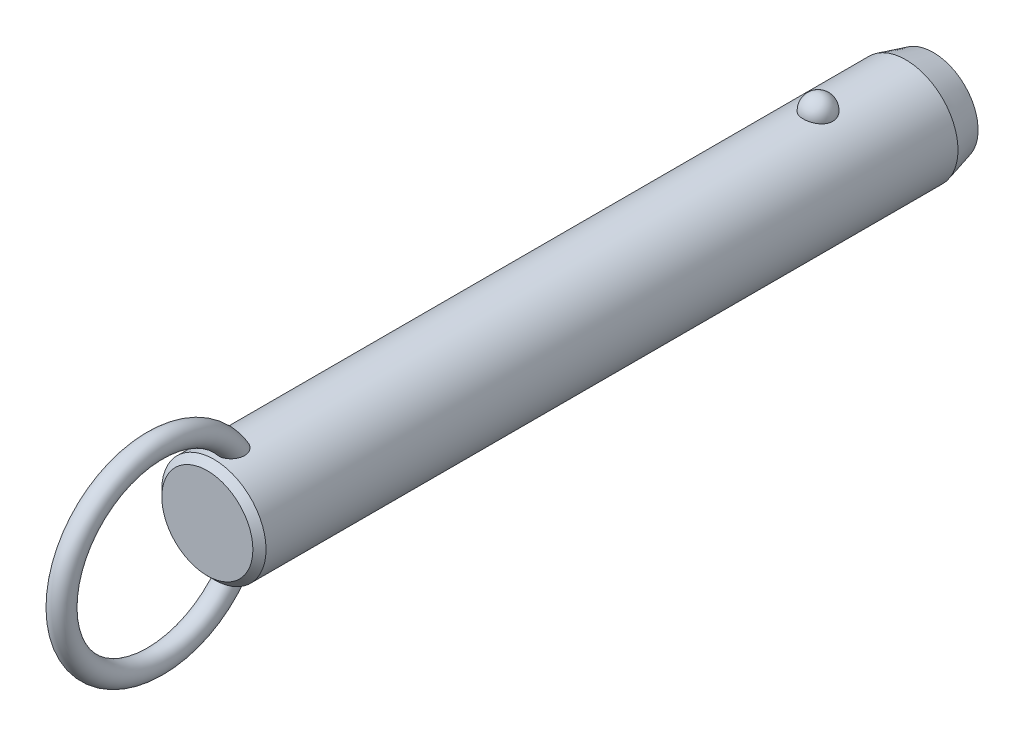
ISO-10303-21;
HEADER;
FILE_DESCRIPTION(('STEP AP214'),'2;1');
FILE_NAME('part.step','',(''),(''),'','','');
FILE_SCHEMA(('AUTOMOTIVE_DESIGN { 1 0 10303 214 1 1 1 1 }'));
ENDSEC;
DATA;
#1=APPLICATION_CONTEXT('core data for automotive mechanical design processes');
#2=APPLICATION_PROTOCOL_DEFINITION('international standard','automotive_design',2000,#1);
#3=PRODUCT_CONTEXT('',#1,'mechanical');
#4=PRODUCT('Part','Part','',(#3));
#5=PRODUCT_RELATED_PRODUCT_CATEGORY('part','',(#4));
#6=PRODUCT_DEFINITION_FORMATION('','',#4);
#7=PRODUCT_DEFINITION_CONTEXT('part definition',#1,'design');
#8=PRODUCT_DEFINITION('design','',#6,#7);
#9=PRODUCT_DEFINITION_SHAPE('','',#8);
#10=(LENGTH_UNIT() NAMED_UNIT(*) SI_UNIT(.MILLI.,.METRE.));
#11=(NAMED_UNIT(*) PLANE_ANGLE_UNIT() SI_UNIT($,.RADIAN.));
#12=(NAMED_UNIT(*) SI_UNIT($,.STERADIAN.) SOLID_ANGLE_UNIT());
#13=UNCERTAINTY_MEASURE_WITH_UNIT(LENGTH_MEASURE(1.E-05),#10,'distance_accuracy_value','');
#14=(GEOMETRIC_REPRESENTATION_CONTEXT(3) GLOBAL_UNCERTAINTY_ASSIGNED_CONTEXT((#13)) GLOBAL_UNIT_ASSIGNED_CONTEXT((#10,
#11,#12)) REPRESENTATION_CONTEXT('',''));
#15=CARTESIAN_POINT('',(0.,0.,0.));
#16=DIRECTION('',(0.,0.,1.));
#17=DIRECTION('',(1.,0.,0.));
#18=AXIS2_PLACEMENT_3D('',#15,#16,#17);
#19=CARTESIAN_POINT('',(0.,0.,99.1));
#20=DIRECTION('',(0.,0.,-1.));
#21=DIRECTION('',(-1.,0.,0.));
#22=AXIS2_PLACEMENT_3D('',#19,#20,#21);
#23=CYLINDRICAL_SURFACE('',#22,9.5);
#24=CARTESIAN_POINT('',(2.67259918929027,9.11631578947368,-2.70000000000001));
#25=CARTESIAN_POINT('',(2.6725968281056,9.11631786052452,-2.54909854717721));
#26=CARTESIAN_POINT('',(2.66030567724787,9.11994722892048,-2.39816735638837));
#27=CARTESIAN_POINT('',(2.6114347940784,9.13405924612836,-2.10058568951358));
#28=CARTESIAN_POINT('',(2.57484658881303,9.14454428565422,-1.95393672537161));
#29=CARTESIAN_POINT('',(2.47830875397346,9.17117631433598,-1.66916069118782));
#30=CARTESIAN_POINT('',(2.41836936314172,9.18732082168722,-1.53102991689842));
#31=CARTESIAN_POINT('',(2.27661331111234,9.22346780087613,-1.26705393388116));
#32=CARTESIAN_POINT('',(2.19479699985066,9.24347021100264,-1.14120852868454));
#33=CARTESIAN_POINT('',(2.01085282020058,9.28522401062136,-0.904632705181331));
#34=CARTESIAN_POINT('',(1.90862396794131,9.30698376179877,-0.793982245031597));
#35=CARTESIAN_POINT('',(1.6867437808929,9.34973971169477,-0.591607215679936));
#36=CARTESIAN_POINT('',(1.56709244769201,9.37073591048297,-0.499882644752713));
#37=CARTESIAN_POINT('',(1.31393976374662,9.40956370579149,-0.338167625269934));
#38=CARTESIAN_POINT('',(1.18048026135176,9.42740444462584,-0.268113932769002));
#39=CARTESIAN_POINT('',(0.903154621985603,9.45799906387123,-0.151390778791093));
#40=CARTESIAN_POINT('',(0.759289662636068,9.47075351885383,-0.104718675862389));
#41=CARTESIAN_POINT('',(0.468074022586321,9.48956256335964,-0.0367633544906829));
#42=CARTESIAN_POINT('',(0.320836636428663,9.49573643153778,-0.0150275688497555));
#43=CARTESIAN_POINT('',(0.0246714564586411,9.50112183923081,0.00396199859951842));
#44=CARTESIAN_POINT('',(-0.124256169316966,9.50033406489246,0.00121819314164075));
#45=CARTESIAN_POINT('',(-0.417264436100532,9.4919475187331,-0.0284441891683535));
#46=CARTESIAN_POINT('',(-0.56138413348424,9.48444885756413,-0.0550074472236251));
#47=CARTESIAN_POINT('',(-0.842986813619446,9.46357853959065,-0.131064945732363));
#48=CARTESIAN_POINT('',(-0.980469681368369,9.450206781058,-0.180559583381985));
#49=CARTESIAN_POINT('',(-1.24585005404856,9.41890822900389,-0.301476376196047));
#50=CARTESIAN_POINT('',(-1.37368611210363,9.40095498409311,-0.373026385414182));
#51=CARTESIAN_POINT('',(-1.61552738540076,9.36242964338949,-0.536025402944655));
#52=CARTESIAN_POINT('',(-1.72953116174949,9.34185727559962,-0.627476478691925));
#53=CARTESIAN_POINT('',(-1.9429225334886,9.29984568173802,-0.829844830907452));
#54=CARTESIAN_POINT('',(-2.04198021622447,9.27839736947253,-0.94110821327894));
#55=CARTESIAN_POINT('',(-2.22026460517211,9.23735994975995,-1.17883414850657));
#56=CARTESIAN_POINT('',(-2.29948985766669,9.21777097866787,-1.30529781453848));
#57=CARTESIAN_POINT('',(-2.43697287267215,9.18238994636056,-1.57158566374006));
#58=CARTESIAN_POINT('',(-2.49497068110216,9.16664569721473,-1.71155057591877));
#59=CARTESIAN_POINT('',(-2.5872073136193,9.14104303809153,-1.99961197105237));
#60=CARTESIAN_POINT('',(-2.62144683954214,9.13118445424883,-2.14770821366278));
#61=CARTESIAN_POINT('',(-2.66521466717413,9.11850622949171,-2.44715424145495));
#62=CARTESIAN_POINT('',(-2.67484831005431,9.11565658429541,-2.59848735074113));
#63=CARTESIAN_POINT('',(-2.66946735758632,9.11723375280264,-2.90067317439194));
#64=CARTESIAN_POINT('',(-2.65445345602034,9.12166036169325,-3.05152590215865));
#65=CARTESIAN_POINT('',(-2.60029711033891,9.13724422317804,-3.34766110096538));
#66=CARTESIAN_POINT('',(-2.56127978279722,9.14836656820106,-3.49296833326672));
#67=CARTESIAN_POINT('',(-2.46018844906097,9.17606676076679,-3.77477535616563));
#68=CARTESIAN_POINT('',(-2.39811349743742,9.1926448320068,-3.9112747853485));
#69=CARTESIAN_POINT('',(-2.25202303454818,9.22952198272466,-4.17244273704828));
#70=CARTESIAN_POINT('',(-2.16788714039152,9.24984129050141,-4.29704106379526));
#71=CARTESIAN_POINT('',(-1.9799408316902,9.29188255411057,-4.53013066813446));
#72=CARTESIAN_POINT('',(-1.87612963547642,9.31360456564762,-4.63862130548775));
#73=CARTESIAN_POINT('',(-1.65105429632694,9.35612959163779,-4.8369029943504));
#74=CARTESIAN_POINT('',(-1.52972405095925,9.37692871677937,-4.92661991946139));
#75=CARTESIAN_POINT('',(-1.27318250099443,9.41518970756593,-5.08429106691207));
#76=CARTESIAN_POINT('',(-1.13797219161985,9.432651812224,-5.15224684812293));
#77=CARTESIAN_POINT('',(-0.859280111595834,9.46208255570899,-5.26371827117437));
#78=CARTESIAN_POINT('',(-0.715925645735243,9.47411833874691,-5.30753421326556));
#79=CARTESIAN_POINT('',(-0.423550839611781,9.4916822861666,-5.37076321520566));
#80=CARTESIAN_POINT('',(-0.2745312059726,9.49721125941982,-5.39017930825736));
#81=CARTESIAN_POINT('',(0.0218446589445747,9.50110860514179,-5.40390587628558));
#82=CARTESIAN_POINT('',(0.16917707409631,9.49961381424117,-5.39869609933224));
#83=CARTESIAN_POINT('',(0.460808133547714,9.48993906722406,-5.36441955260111));
#84=CARTESIAN_POINT('',(0.605106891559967,9.48175936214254,-5.33535367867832));
#85=CARTESIAN_POINT('',(0.886027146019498,9.4596376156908,-5.25435587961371));
#86=CARTESIAN_POINT('',(1.02267710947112,9.44571881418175,-5.20251612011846));
#87=CARTESIAN_POINT('',(1.28523827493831,9.41358993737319,-5.07741549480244));
#88=CARTESIAN_POINT('',(1.41114877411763,9.39537958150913,-5.00415322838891));
#89=CARTESIAN_POINT('',(1.65085227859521,9.3562644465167,-4.83684599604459));
#90=CARTESIAN_POINT('',(1.76442346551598,9.33532178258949,-4.74249218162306));
#91=CARTESIAN_POINT('',(1.97425672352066,9.29321198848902,-4.53620389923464));
#92=CARTESIAN_POINT('',(2.07051582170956,9.27204482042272,-4.42426641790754));
#93=CARTESIAN_POINT('',(2.24490086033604,9.23139221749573,-4.18363183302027));
#94=CARTESIAN_POINT('',(2.32267019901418,9.21194380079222,-4.05466990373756));
#95=CARTESIAN_POINT('',(2.45584092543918,9.1773419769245,-3.78517836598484));
#96=CARTESIAN_POINT('',(2.5112497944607,9.16218713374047,-3.64465264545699));
#97=CARTESIAN_POINT('',(2.59380876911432,9.13913522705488,-3.37104301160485));
#98=CARTESIAN_POINT('',(2.62330266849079,9.13064624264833,-3.23871053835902));
#99=CARTESIAN_POINT('',(2.66269870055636,9.11923566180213,-2.97092664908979));
#100=CARTESIAN_POINT('',(2.67260130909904,9.11631393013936,-2.83547530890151));
#101=CARTESIAN_POINT('',(2.67259918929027,9.11631578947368,-2.70000000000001));
#102=B_SPLINE_CURVE_WITH_KNOTS('',3,(#24,#25,#26,#27,#28,#29,#30,#31,#32,#33,#34,#35,#36,#37,
#38,#39,#40,#41,#42,#43,#44,#45,#46,#47,#48,#49,#50,#51,#52,#53,#54,#55,#56,#57,#58,#59,#60,#61,
#62,#63,#64,#65,#66,#67,#68,#69,#70,#71,#72,#73,#74,#75,#76,#77,#78,#79,#80,#81,#82,#83,#84,#85,
#86,#87,#88,#89,#90,#91,#92,#93,#94,#95,#96,#97,#98,#99,#100,#101),.UNSPECIFIED.,.T.,.F.,(4,2,2,
2,2,2,2,2,2,2,2,2,2,2,2,2,2,2,2,2,2,2,2,2,2,2,2,2,2,2,2,2,2,2,2,2,2,2,4),(0.,0.452217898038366,
0.904593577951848,1.35677112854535,1.80894144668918,2.26340676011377,2.71787203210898,
3.17099820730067,3.62407318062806,4.0687883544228,4.51345969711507,4.95160616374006,
5.38976021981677,5.83050358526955,6.27129275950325,6.72071308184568,7.17016633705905,
7.62495278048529,8.07972578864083,8.53254856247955,8.98535859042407,9.43582813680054,
9.88631615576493,10.3393155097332,10.7923328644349,11.2471065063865,11.7018475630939,
12.150795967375,12.599688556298,13.0398725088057,13.4800399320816,13.9184421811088,
14.3568730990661,14.802202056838,15.2476074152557,15.7010097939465,16.1542603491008,
16.5602594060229,16.966248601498),.UNSPECIFIED.);
#103=CARTESIAN_POINT('',(2.67259918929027,9.11631578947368,-2.70000000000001));
#104=VERTEX_POINT('',#103);
#105=EDGE_CURVE('E41',#104,#104,#102,.T.);
#106=ORIENTED_EDGE('',*,*,#105,.T.);
#107=EDGE_LOOP('',(#106));
#108=FACE_BOUND('',#107,.T.);
#109=CARTESIAN_POINT('',(0.,0.,107.42));
#110=DIRECTION('',(0.,0.,1.));
#111=DIRECTION('',(1.,0.,0.));
#112=AXIS2_PLACEMENT_3D('',#109,#110,#111);
#113=CIRCLE('',#112,9.5);
#114=CARTESIAN_POINT('',(9.5,0.,107.42));
#115=VERTEX_POINT('',#114);
#116=EDGE_CURVE('E10',#115,#115,#113,.F.);
#117=ORIENTED_EDGE('',*,*,#116,.T.);
#118=EDGE_LOOP('',(#117));
#119=FACE_BOUND('',#118,.T.);
#120=CARTESIAN_POINT('',(-0.697062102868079,-9.47439269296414,101.767808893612));
#121=CARTESIAN_POINT('',(-0.799579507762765,-9.46685146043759,101.807482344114));
#122=CARTESIAN_POINT('',(-0.898575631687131,-9.45788043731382,101.8559309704));
#123=CARTESIAN_POINT('',(-1.08670047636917,-9.43811593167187,101.968868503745));
#124=CARTESIAN_POINT('',(-1.17583204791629,-9.42732297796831,102.033352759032));
#125=CARTESIAN_POINT('',(-1.34179806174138,-9.40513672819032,102.176209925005));
#126=CARTESIAN_POINT('',(-1.41865133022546,-9.39374438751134,102.254561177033));
#127=CARTESIAN_POINT('',(-1.5586004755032,-9.37154196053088,102.422752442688));
#128=CARTESIAN_POINT('',(-1.62169476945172,-9.3607319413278,102.51259377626));
#129=CARTESIAN_POINT('',(-1.73527695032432,-9.34035749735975,102.704500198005));
#130=CARTESIAN_POINT('',(-1.7852226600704,-9.33085270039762,102.806891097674));
#131=CARTESIAN_POINT('',(-1.86924997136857,-9.3143834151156,103.018148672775));
#132=CARTESIAN_POINT('',(-1.90332570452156,-9.30741986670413,103.127017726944));
#133=CARTESIAN_POINT('',(-1.95893603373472,-9.29588482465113,103.360473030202));
#134=CARTESIAN_POINT('',(-1.97872420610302,-9.29165182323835,103.485489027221));
#135=CARTESIAN_POINT('',(-2.00062129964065,-9.28695978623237,103.737080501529));
#136=CARTESIAN_POINT('',(-2.00272284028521,-9.28650232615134,103.863656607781));
#137=CARTESIAN_POINT('',(-1.98958876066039,-9.28932750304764,104.136815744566));
#138=CARTESIAN_POINT('',(-1.97143366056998,-9.2932400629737,104.283251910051));
#139=CARTESIAN_POINT('',(-1.91479925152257,-9.30507151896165,104.572062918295));
#140=CARTESIAN_POINT('',(-1.87629122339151,-9.31299607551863,104.714431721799));
#141=CARTESIAN_POINT('',(-1.77225683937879,-9.33340232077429,105.015172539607));
#142=CARTESIAN_POINT('',(-1.70334898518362,-9.34641636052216,105.172369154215));
#143=CARTESIAN_POINT('',(-1.58111062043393,-9.36759153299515,105.397517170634));
#144=CARTESIAN_POINT('',(-1.53721459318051,-9.37492619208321,105.470796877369));
#145=CARTESIAN_POINT('',(-1.44302631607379,-9.38988566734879,105.61307405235));
#146=CARTESIAN_POINT('',(-1.39273721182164,-9.39751033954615,105.682073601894));
#147=CARTESIAN_POINT('',(-1.26775962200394,-9.41530678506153,105.836983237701));
#148=CARTESIAN_POINT('',(-1.19052326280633,-9.42548108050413,105.920871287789));
#149=CARTESIAN_POINT('',(-1.02420241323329,-9.44499825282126,106.076008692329));
#150=CARTESIAN_POINT('',(-0.935139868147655,-9.45434261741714,106.147280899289));
#151=CARTESIAN_POINT('',(-0.766610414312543,-9.46930670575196,106.258695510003));
#152=CARTESIAN_POINT('',(-0.689439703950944,-9.47529223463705,106.302235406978));
#153=CARTESIAN_POINT('',(-0.528942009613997,-9.48560294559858,106.37631336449));
#154=CARTESIAN_POINT('',(-0.445620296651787,-9.48992953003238,106.406862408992));
#155=CARTESIAN_POINT('',(-0.273901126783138,-9.49644161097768,106.452579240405));
#156=CARTESIAN_POINT('',(-0.185465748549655,-9.49860811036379,106.46761059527));
#157=CARTESIAN_POINT('',(-0.00734541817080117,-9.5004135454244,106.480149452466));
#158=CARTESIAN_POINT('',(0.0823387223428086,-9.50005405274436,106.477667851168));
#159=CARTESIAN_POINT('',(0.247679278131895,-9.49708301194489,106.456995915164));
#160=CARTESIAN_POINT('',(0.323620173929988,-9.49477609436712,106.440930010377));
#161=CARTESIAN_POINT('',(0.471981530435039,-9.48855917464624,106.397172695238));
#162=CARTESIAN_POINT('',(0.544400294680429,-9.48464840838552,106.369475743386));
#163=CARTESIAN_POINT('',(0.70894789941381,-9.47398336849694,106.29280266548));
#164=CARTESIAN_POINT('',(0.799149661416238,-9.46671310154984,106.239774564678));
#165=CARTESIAN_POINT('',(0.969783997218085,-9.45076225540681,106.119973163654));
#166=CARTESIAN_POINT('',(1.05019415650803,-9.44207854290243,106.053169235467));
#167=CARTESIAN_POINT('',(1.23092343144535,-9.42051459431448,105.880759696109));
#168=CARTESIAN_POINT('',(1.3265249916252,-9.40733378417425,105.77026193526));
#169=CARTESIAN_POINT('',(1.49893121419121,-9.38140745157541,105.535561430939));
#170=CARTESIAN_POINT('',(1.57571616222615,-9.36866239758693,105.411344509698));
#171=CARTESIAN_POINT('',(1.71285426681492,-9.34457644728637,105.149389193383));
#172=CARTESIAN_POINT('',(1.77266365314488,-9.33328726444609,105.01136233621));
#173=CARTESIAN_POINT('',(1.87239208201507,-9.31379209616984,104.728051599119));
#174=CARTESIAN_POINT('',(1.9123015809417,-9.3055875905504,104.582764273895));
#175=CARTESIAN_POINT('',(1.97604189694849,-9.29228394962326,104.262028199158));
#176=CARTESIAN_POINT('',(1.99587438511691,-9.28797202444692,104.085724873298));
#177=CARTESIAN_POINT('',(2.0029570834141,-9.28645519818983,103.732414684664));
#178=CARTESIAN_POINT('',(1.99025930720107,-9.28923895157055,103.555409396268));
#179=CARTESIAN_POINT('',(1.93735479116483,-9.30038134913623,103.256338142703));
#180=CARTESIAN_POINT('',(1.90576827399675,-9.30697680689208,103.132667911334));
#181=CARTESIAN_POINT('',(1.82287484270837,-9.32356855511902,102.892329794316));
#182=CARTESIAN_POINT('',(1.77158213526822,-9.33356239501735,102.775656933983));
#183=CARTESIAN_POINT('',(1.64885744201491,-9.35602275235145,102.552706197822));
#184=CARTESIAN_POINT('',(1.57730995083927,-9.36850332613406,102.446492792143));
#185=CARTESIAN_POINT('',(1.4154326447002,-9.39431873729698,102.249553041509));
#186=CARTESIAN_POINT('',(1.32510883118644,-9.40765330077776,102.158821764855));
#187=CARTESIAN_POINT('',(1.13846223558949,-9.43195720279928,102.005033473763));
#188=CARTESIAN_POINT('',(1.04369890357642,-9.44302894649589,101.940094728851));
#189=CARTESIAN_POINT('',(0.843965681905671,-9.46296805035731,101.828038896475));
#190=CARTESIAN_POINT('',(0.739000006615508,-9.47183631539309,101.780914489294));
#191=CARTESIAN_POINT('',(0.528175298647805,-9.48586140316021,101.708117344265));
#192=CARTESIAN_POINT('',(0.422686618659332,-9.49119633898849,101.68140249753));
#193=CARTESIAN_POINT('',(0.208590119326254,-9.49831365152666,101.646013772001));
#194=CARTESIAN_POINT('',(0.0999817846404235,-9.500095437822,101.637342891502));
#195=CARTESIAN_POINT('',(-0.126104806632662,-9.49988861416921,101.638350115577));
#196=CARTESIAN_POINT('',(-0.24357872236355,-9.49757821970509,101.649594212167));
#197=CARTESIAN_POINT('',(-0.474390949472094,-9.48885165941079,101.693167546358));
#198=CARTESIAN_POINT('',(-0.587729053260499,-9.48243528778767,101.725497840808));
#199=CARTESIAN_POINT('',(-0.697062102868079,-9.47439269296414,101.767808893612));
#200=B_SPLINE_CURVE_WITH_KNOTS('',3,(#120,#121,#122,#123,#124,#125,#126,#127,#128,#129,#130,
#131,#132,#133,#134,#135,#136,#137,#138,#139,#140,#141,#142,#143,#144,#145,#146,#147,#148,#149,
#150,#151,#152,#153,#154,#155,#156,#157,#158,#159,#160,#161,#162,#163,#164,#165,#166,#167,#168,
#169,#170,#171,#172,#173,#174,#175,#176,#177,#178,#179,#180,#181,#182,#183,#184,#185,#186,#187,
#188,#189,#190,#191,#192,#193,#194,#195,#196,#197,#198,#199),.UNSPECIFIED.,.T.,.F.,(4,2,2,2,2,2,
2,2,2,2,2,2,2,2,2,2,2,2,2,2,2,2,2,2,2,2,2,2,2,2,2,2,2,2,2,2,2,2,2,4),(0.,0.330119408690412,
0.660143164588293,0.989655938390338,1.31920659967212,1.66074728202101,2.00241415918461,
2.38088696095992,2.7595176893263,3.20065679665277,3.6424200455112,4.15620996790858,
4.41314162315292,4.66994734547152,5.01228664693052,5.35399933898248,5.61943037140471,
5.88463652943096,6.15215502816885,6.41950709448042,6.65144391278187,6.88349136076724,
7.19641200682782,7.51003602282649,7.94779711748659,8.38601491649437,8.83699707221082,
9.28819530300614,9.81778662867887,10.3465317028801,10.7284172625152,11.110028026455,
11.4938603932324,11.8775702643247,12.2220189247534,12.5663259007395,12.8915939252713,
13.2169159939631,13.5689650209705,13.9210316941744),.UNSPECIFIED.);
#201=CARTESIAN_POINT('',(-0.697062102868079,-9.47439269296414,101.767808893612));
#202=VERTEX_POINT('',#201);
#203=EDGE_CURVE('E59',#202,#202,#200,.T.);
#204=ORIENTED_EDGE('',*,*,#203,.T.);
#205=EDGE_LOOP('',(#204));
#206=FACE_BOUND('',#205,.T.);
#207=CARTESIAN_POINT('',(-0.697062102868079,9.47439269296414,101.767808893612));
#208=CARTESIAN_POINT('',(-0.597792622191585,9.48169483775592,101.72939564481));
#209=CARTESIAN_POINT('',(-0.495106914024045,9.48766580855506,101.699168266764));
#210=CARTESIAN_POINT('',(-0.285876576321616,9.49627648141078,101.656032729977));
#211=CARTESIAN_POINT('',(-0.179324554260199,9.49890941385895,101.643159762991));
#212=CARTESIAN_POINT('',(0.034415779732,9.50053798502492,101.635166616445));
#213=CARTESIAN_POINT('',(0.141603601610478,9.49953613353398,101.640034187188));
#214=CARTESIAN_POINT('',(0.353563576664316,9.49401038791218,101.667365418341));
#215=CARTESIAN_POINT('',(0.458336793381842,9.48948807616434,101.68982117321));
#216=CARTESIAN_POINT('',(0.66249373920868,9.4774236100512,101.751671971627));
#217=CARTESIAN_POINT('',(0.761881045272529,9.46988348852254,101.791055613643));
#218=CARTESIAN_POINT('',(0.952608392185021,9.45260382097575,101.885634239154));
#219=CARTESIAN_POINT('',(1.04394806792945,9.44286417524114,101.940829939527));
#220=CARTESIAN_POINT('',(1.21712767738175,9.42211760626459,102.066066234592));
#221=CARTESIAN_POINT('',(1.29885671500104,9.41109835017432,102.136257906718));
#222=CARTESIAN_POINT('',(1.44978975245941,9.38903310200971,102.288980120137));
#223=CARTESIAN_POINT('',(1.51899278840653,9.37798710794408,102.371511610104));
#224=CARTESIAN_POINT('',(1.64602857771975,9.35654375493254,102.549776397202));
#225=CARTESIAN_POINT('',(1.70333052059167,9.34618688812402,102.645891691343));
#226=CARTESIAN_POINT('',(1.80259341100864,9.32755128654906,102.845897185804));
#227=CARTESIAN_POINT('',(1.84454942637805,9.31927322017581,102.949789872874));
#228=CARTESIAN_POINT('',(1.91637039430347,9.30478365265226,103.172213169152));
#229=CARTESIAN_POINT('',(1.944805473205,9.29882552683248,103.291219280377));
#230=CARTESIAN_POINT('',(1.98449865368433,9.29043398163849,103.532143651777));
#231=CARTESIAN_POINT('',(1.99574908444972,9.28800213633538,103.654063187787));
#232=CARTESIAN_POINT('',(2.00275141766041,9.28649645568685,103.916932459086));
#233=CARTESIAN_POINT('',(1.99588238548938,9.28799035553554,104.057952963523));
#234=CARTESIAN_POINT('',(1.96270559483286,9.29505517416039,104.337621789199));
#235=CARTESIAN_POINT('',(1.93637872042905,9.30063010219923,104.476267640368));
#236=CARTESIAN_POINT('',(1.85949176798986,9.31633564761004,104.772561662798));
#237=CARTESIAN_POINT('',(1.80549792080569,9.3270926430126,104.929290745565));
#238=CARTESIAN_POINT('',(1.67376869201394,9.3516306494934,105.232284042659));
#239=CARTESIAN_POINT('',(1.59603181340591,9.36541185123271,105.378547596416));
#240=CARTESIAN_POINT('',(1.4360277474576,9.39110706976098,105.625813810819));
#241=CARTESIAN_POINT('',(1.35831795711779,9.40278656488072,105.729791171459));
#242=CARTESIAN_POINT('',(1.18774483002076,9.42585025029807,105.924534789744));
#243=CARTESIAN_POINT('',(1.09490932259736,9.43723493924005,106.015324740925));
#244=CARTESIAN_POINT('',(0.921110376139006,9.45552616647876,106.15620334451));
#245=CARTESIAN_POINT('',(0.843738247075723,9.46281058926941,106.210656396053));
#246=CARTESIAN_POINT('',(0.681245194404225,9.47589120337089,106.306711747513));
#247=CARTESIAN_POINT('',(0.596135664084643,9.48168953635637,106.348332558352));
#248=CARTESIAN_POINT('',(0.433779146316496,9.49038144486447,106.410089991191));
#249=CARTESIAN_POINT('',(0.357459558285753,9.49359170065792,106.43260136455));
#250=CARTESIAN_POINT('',(0.202074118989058,9.49816761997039,106.464574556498));
#251=CARTESIAN_POINT('',(0.123010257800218,9.49953459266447,106.474045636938));
#252=CARTESIAN_POINT('',(-0.0357372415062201,9.50026497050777,106.479114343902));
#253=CARTESIAN_POINT('',(-0.115421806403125,9.49962433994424,106.474684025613));
#254=CARTESIAN_POINT('',(-0.272823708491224,9.49640854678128,106.452296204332));
#255=CARTESIAN_POINT('',(-0.350540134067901,9.4938325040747,106.434332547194));
#256=CARTESIAN_POINT('',(-0.500580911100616,9.4870946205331,106.386802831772));
#257=CARTESIAN_POINT('',(-0.57297929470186,9.48296359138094,106.357461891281));
#258=CARTESIAN_POINT('',(-0.712864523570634,9.47347609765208,106.289008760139));
#259=CARTESIAN_POINT('',(-0.780349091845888,9.46811906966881,106.249892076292));
#260=CARTESIAN_POINT('',(-0.946309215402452,9.45329720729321,106.139432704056));
#261=CARTESIAN_POINT('',(-1.04090230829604,9.44321512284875,106.062329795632));
#262=CARTESIAN_POINT('',(-1.21661929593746,9.42219227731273,105.89409718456));
#263=CARTESIAN_POINT('',(-1.29770519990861,9.41124921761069,105.802929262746));
#264=CARTESIAN_POINT('',(-1.47319646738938,9.38563439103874,105.576162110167));
#265=CARTESIAN_POINT('',(-1.56208878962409,9.37102009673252,105.436289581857));
#266=CARTESIAN_POINT('',(-1.71623987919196,9.34401559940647,105.143950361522));
#267=CARTESIAN_POINT('',(-1.78147866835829,9.33162728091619,104.991473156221));
#268=CARTESIAN_POINT('',(-1.88853837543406,9.31055541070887,104.675647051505));
#269=CARTESIAN_POINT('',(-1.92998995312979,9.30193076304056,104.512168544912));
#270=CARTESIAN_POINT('',(-1.98590726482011,9.29015757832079,104.180526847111));
#271=CARTESIAN_POINT('',(-2.0004070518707,9.2870021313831,104.012369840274));
#272=CARTESIAN_POINT('',(-1.99964701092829,9.28716218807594,103.705080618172));
#273=CARTESIAN_POINT('',(-1.98908145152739,9.28945704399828,103.565936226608));
#274=CARTESIAN_POINT('',(-1.94566294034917,9.29865169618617,103.291153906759));
#275=CARTESIAN_POINT('',(-1.91282062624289,9.30554929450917,103.155514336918));
#276=CARTESIAN_POINT('',(-1.84582133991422,9.31898248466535,102.957802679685));
#277=CARTESIAN_POINT('',(-1.82038084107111,9.32400364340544,102.892583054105));
#278=CARTESIAN_POINT('',(-1.7635051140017,9.33492884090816,102.764903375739));
#279=CARTESIAN_POINT('',(-1.73207305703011,9.34083241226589,102.702441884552));
#280=CARTESIAN_POINT('',(-1.6632424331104,9.353333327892,102.58094078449));
#281=CARTESIAN_POINT('',(-1.62584239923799,9.35993084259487,102.521902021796));
#282=CARTESIAN_POINT('',(-1.54527678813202,9.37356864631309,102.407987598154));
#283=CARTESIAN_POINT('',(-1.50211241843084,9.38060884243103,102.353111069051));
#284=CARTESIAN_POINT('',(-1.37681147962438,9.40004442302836,102.209961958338));
#285=CARTESIAN_POINT('',(-1.28916358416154,9.41261047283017,102.126429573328));
#286=CARTESIAN_POINT('',(-1.09996826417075,9.43658180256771,101.977236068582));
#287=CARTESIAN_POINT('',(-0.998461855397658,9.44799034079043,101.911523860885));
#288=CARTESIAN_POINT('',(-0.860188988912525,9.46103017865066,101.8394367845));
#289=CARTESIAN_POINT('',(-0.828141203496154,9.46389141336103,101.823851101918));
#290=CARTESIAN_POINT('',(-0.763210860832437,9.46934915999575,101.794473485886));
#291=CARTESIAN_POINT('',(-0.730328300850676,9.47194567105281,101.780681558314));
#292=CARTESIAN_POINT('',(-0.697062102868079,9.47439269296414,101.767808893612));
#293=B_SPLINE_CURVE_WITH_KNOTS('',3,(#207,#208,#209,#210,#211,#212,#213,#214,#215,#216,#217,
#218,#219,#220,#221,#222,#223,#224,#225,#226,#227,#228,#229,#230,#231,#232,#233,#234,#235,#236,
#237,#238,#239,#240,#241,#242,#243,#244,#245,#246,#247,#248,#249,#250,#251,#252,#253,#254,#255,
#256,#257,#258,#259,#260,#261,#262,#263,#264,#265,#266,#267,#268,#269,#270,#271,#272,#273,#274,
#275,#276,#277,#278,#279,#280,#281,#282,#283,#284,#285,#286,#287,#288,#289,#290,#291,#292),
.UNSPECIFIED.,.T.,.F.,(4,2,2,2,2,2,2,2,2,2,2,2,2,2,2,2,2,2,2,2,2,2,2,2,2,2,2,2,2,2,2,2,2,2,2,2,
2,2,2,2,2,2,4),(0.,0.319942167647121,0.640532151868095,0.960900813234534,1.28112555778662,
1.60113495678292,1.92115886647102,2.24457323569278,2.56801248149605,2.90371927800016,
3.23953387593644,3.60560313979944,3.97183576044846,4.39383693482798,4.81625324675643,
5.31257045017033,5.80891895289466,6.19868344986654,6.58773876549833,6.87145417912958,
7.15475838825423,7.3926375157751,7.63034760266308,7.86853584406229,8.10683246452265,
8.3406366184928,8.57454843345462,8.93983939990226,9.30614105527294,9.8026666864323,
10.2996107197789,10.8040753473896,11.3079021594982,11.7249776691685,12.1418541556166,
12.3521485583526,12.562331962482,12.7725671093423,12.9827582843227,13.345827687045,
13.7078449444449,13.8150604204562,13.9222762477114),.UNSPECIFIED.);
#294=CARTESIAN_POINT('',(-0.697062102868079,9.47439269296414,101.767808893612));
#295=VERTEX_POINT('',#294);
#296=EDGE_CURVE('E66',#295,#295,#293,.T.);
#297=ORIENTED_EDGE('',*,*,#296,.T.);
#298=EDGE_LOOP('',(#297));
#299=FACE_BOUND('',#298,.T.);
#300=CARTESIAN_POINT('',(0.,0.,-18.6999999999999));
#301=DIRECTION('',(0.,0.,-1.));
#302=DIRECTION('',(-1.,0.,0.));
#303=AXIS2_PLACEMENT_3D('',#300,#301,#302);
#304=CIRCLE('',#303,9.5);
#305=CARTESIAN_POINT('',(-9.5,0.,-18.6999999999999));
#306=VERTEX_POINT('',#305);
#307=EDGE_CURVE('E56',#306,#306,#304,.F.);
#308=ORIENTED_EDGE('',*,*,#307,.T.);
#309=EDGE_LOOP('',(#308));
#310=FACE_BOUND('',#309,.T.);
#311=ADVANCED_FACE('F37',(#108,#119,#206,#299,#310),#23,.T.);
#312=CARTESIAN_POINT('',(0.,0.,-23.7));
#313=DIRECTION('',(0.,0.,-1.));
#314=DIRECTION('',(-1.,0.,0.));
#315=AXIS2_PLACEMENT_3D('',#312,#313,#314);
#316=PLANE('',#315);
#317=CARTESIAN_POINT('',(0.,0.,-23.7));
#318=DIRECTION('',(0.,0.,-1.));
#319=DIRECTION('',(-1.,0.,0.));
#320=AXIS2_PLACEMENT_3D('',#317,#318,#319);
#321=CIRCLE('',#320,8.16025403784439);
#322=CARTESIAN_POINT('',(-8.16025403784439,0.,-23.7));
#323=VERTEX_POINT('',#322);
#324=EDGE_CURVE('E65',#323,#323,#321,.T.);
#325=ORIENTED_EDGE('',*,*,#324,.T.);
#326=EDGE_LOOP('',(#325));
#327=FACE_BOUND('',#326,.T.);
#328=ADVANCED_FACE('F84',(#327),#316,.T.);
#329=CARTESIAN_POINT('',(0.,0.,-23.7));
#330=DIRECTION('',(0.,0.,1.));
#331=DIRECTION('',(1.,0.,0.));
#332=AXIS2_PLACEMENT_3D('',#329,#330,#331);
#333=CONICAL_SURFACE('',#332,8.16025403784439,0.261799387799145);
#334=ORIENTED_EDGE('',*,*,#307,.F.);
#335=EDGE_LOOP('',(#334));
#336=FACE_BOUND('',#335,.T.);
#337=ORIENTED_EDGE('',*,*,#324,.F.);
#338=EDGE_LOOP('',(#337));
#339=FACE_BOUND('',#338,.T.);
#340=ADVANCED_FACE('F82',(#336,#339),#333,.T.);
#341=CARTESIAN_POINT('',(0.,0.,108.62));
#342=DIRECTION('',(0.,0.,1.));
#343=DIRECTION('',(1.,0.,0.));
#344=AXIS2_PLACEMENT_3D('',#341,#342,#343);
#345=PLANE('',#344);
#346=CARTESIAN_POINT('',(0.,0.,108.62));
#347=DIRECTION('',(0.,0.,1.));
#348=DIRECTION('',(1.,0.,0.));
#349=AXIS2_PLACEMENT_3D('',#346,#347,#348);
#350=CIRCLE('',#349,8.30000000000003);
#351=CARTESIAN_POINT('',(8.30000000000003,0.,108.62));
#352=VERTEX_POINT('',#351);
#353=EDGE_CURVE('E50',#352,#352,#350,.T.);
#354=ORIENTED_EDGE('',*,*,#353,.T.);
#355=EDGE_LOOP('',(#354));
#356=FACE_BOUND('',#355,.T.);
#357=ADVANCED_FACE('F76',(#356),#345,.T.);
#358=CARTESIAN_POINT('',(0.,0.,118.15));
#359=DIRECTION('',(1.,0.,0.));
#360=DIRECTION('',(0.,0.,-1.));
#361=AXIS2_PLACEMENT_3D('',#358,#359,#360);
#362=TOROIDAL_SURFACE('',#361,17.05,2.);
#363=ORIENTED_EDGE('',*,*,#296,.F.);
#364=EDGE_LOOP('',(#363));
#365=FACE_BOUND('',#364,.T.);
#366=ORIENTED_EDGE('',*,*,#203,.F.);
#367=EDGE_LOOP('',(#366));
#368=FACE_BOUND('',#367,.T.);
#369=ADVANCED_FACE('F72',(#365,#368),#362,.T.);
#370=CARTESIAN_POINT('',(0.,0.,108.62));
#371=DIRECTION('',(0.,0.,-1.));
#372=DIRECTION('',(-1.,0.,0.));
#373=AXIS2_PLACEMENT_3D('',#370,#371,#372);
#374=CONICAL_SURFACE('',#373,8.30000000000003,0.785398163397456);
#375=ORIENTED_EDGE('',*,*,#116,.F.);
#376=EDGE_LOOP('',(#375));
#377=FACE_BOUND('',#376,.T.);
#378=ORIENTED_EDGE('',*,*,#353,.F.);
#379=EDGE_LOOP('',(#378));
#380=FACE_BOUND('',#379,.T.);
#381=ADVANCED_FACE('F39',(#377,#380),#374,.T.);
#382=CARTESIAN_POINT('',(0.,9.5,-2.70000000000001));
#383=DIRECTION('',(0.,1.,0.));
#384=DIRECTION('',(0.,0.,-1.));
#385=AXIS2_PLACEMENT_3D('',#382,#383,#384);
#386=SPHERICAL_SURFACE('',#385,2.7);
#387=ORIENTED_EDGE('',*,*,#105,.F.);
#388=EDGE_LOOP('',(#387));
#389=FACE_BOUND('',#388,.T.);
#390=ADVANCED_FACE('F78',(#389),#386,.T.);
#391=CLOSED_SHELL('',(#311,#328,#340,#357,#369,#381,#390));
#392=MANIFOLD_SOLID_BREP('B2',#391);
#393=ADVANCED_BREP_SHAPE_REPRESENTATION('',(#18,#392),#14);
#394=SHAPE_DEFINITION_REPRESENTATION(#9,#393);
ENDSEC;
END-ISO-10303-21;
